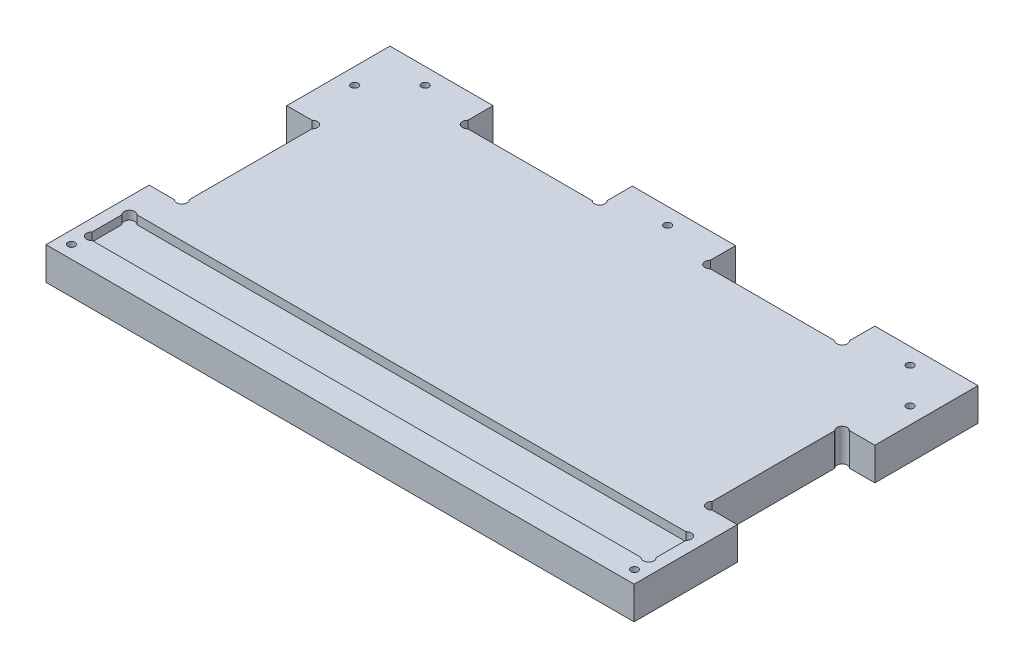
ISO-10303-21;
HEADER;
FILE_DESCRIPTION(('STEP AP214'),'2;1');
FILE_NAME('part.step','',(''),(''),'','','');
FILE_SCHEMA(('AUTOMOTIVE_DESIGN { 1 0 10303 214 1 1 1 1 }'));
ENDSEC;
DATA;
#1=APPLICATION_CONTEXT('core data for automotive mechanical design processes');
#2=APPLICATION_PROTOCOL_DEFINITION('international standard','automotive_design',2000,#1);
#3=PRODUCT_CONTEXT('',#1,'mechanical');
#4=PRODUCT('Part','Part','',(#3));
#5=PRODUCT_RELATED_PRODUCT_CATEGORY('part','',(#4));
#6=PRODUCT_DEFINITION_FORMATION('','',#4);
#7=PRODUCT_DEFINITION_CONTEXT('part definition',#1,'design');
#8=PRODUCT_DEFINITION('design','',#6,#7);
#9=PRODUCT_DEFINITION_SHAPE('','',#8);
#10=(LENGTH_UNIT() NAMED_UNIT(*) SI_UNIT(.MILLI.,.METRE.));
#11=(NAMED_UNIT(*) PLANE_ANGLE_UNIT() SI_UNIT($,.RADIAN.));
#12=(NAMED_UNIT(*) SI_UNIT($,.STERADIAN.) SOLID_ANGLE_UNIT());
#13=UNCERTAINTY_MEASURE_WITH_UNIT(LENGTH_MEASURE(1.E-05),#10,'distance_accuracy_value','');
#14=(GEOMETRIC_REPRESENTATION_CONTEXT(3) GLOBAL_UNCERTAINTY_ASSIGNED_CONTEXT((#13)) GLOBAL_UNIT_ASSIGNED_CONTEXT((#10,
#11,#12)) REPRESENTATION_CONTEXT('',''));
#15=CARTESIAN_POINT('',(0.,0.,0.));
#16=DIRECTION('',(0.,0.,1.));
#17=DIRECTION('',(1.,0.,0.));
#18=AXIS2_PLACEMENT_3D('',#15,#16,#17);
#19=CARTESIAN_POINT('',(332.9,-19.,-17.6));
#20=DIRECTION('',(0.,1.,0.));
#21=DIRECTION('',(0.,0.,1.));
#22=AXIS2_PLACEMENT_3D('',#19,#20,#21);
#23=CYLINDRICAL_SURFACE('',#22,3.09999999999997);
#24=CARTESIAN_POINT('',(332.9,-5.,-17.6));
#25=DIRECTION('',(0.,-1.,0.));
#26=DIRECTION('',(0.,0.,-1.));
#27=AXIS2_PLACEMENT_3D('',#24,#25,#26);
#28=CIRCLE('',#27,3.09999999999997);
#29=CARTESIAN_POINT('',(330.619649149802,-5.,-15.5));
#30=VERTEX_POINT('',#29);
#31=CARTESIAN_POINT('',(335.,-5.,-19.8803508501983));
#32=VERTEX_POINT('',#31);
#33=EDGE_CURVE('E47',#30,#32,#28,.F.);
#34=ORIENTED_EDGE('',*,*,#33,.F.);
#35=DIRECTION('',(0.,1.,0.));
#36=VECTOR('',#35,1.);
#37=CARTESIAN_POINT('',(330.619649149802,-19.,-15.5));
#38=LINE('',#37,#36);
#39=CARTESIAN_POINT('',(330.619649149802,0.,-15.5));
#40=VERTEX_POINT('',#39);
#41=EDGE_CURVE('E354',#30,#40,#38,.T.);
#42=ORIENTED_EDGE('',*,*,#41,.T.);
#43=CARTESIAN_POINT('',(332.9,0.,-17.6));
#44=DIRECTION('',(0.,1.,0.));
#45=DIRECTION('',(0.,0.,1.));
#46=AXIS2_PLACEMENT_3D('',#43,#44,#45);
#47=CIRCLE('',#46,3.09999999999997);
#48=CARTESIAN_POINT('',(335.,0.,-19.8803508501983));
#49=VERTEX_POINT('',#48);
#50=EDGE_CURVE('E331',#40,#49,#47,.T.);
#51=ORIENTED_EDGE('',*,*,#50,.T.);
#52=DIRECTION('',(0.,1.,0.));
#53=VECTOR('',#52,1.);
#54=CARTESIAN_POINT('',(335.,-19.,-19.8803508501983));
#55=LINE('',#54,#53);
#56=EDGE_CURVE('E274',#32,#49,#55,.T.);
#57=ORIENTED_EDGE('',*,*,#56,.F.);
#58=EDGE_LOOP('',(#34,#42,#51,#57));
#59=FACE_BOUND('',#58,.T.);
#60=ADVANCED_FACE('F32',(#59),#23,.F.);
#61=CARTESIAN_POINT('',(11.3803508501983,-19.,-15.5));
#62=DIRECTION('',(0.,0.,1.));
#63=DIRECTION('',(1.,0.,0.));
#64=AXIS2_PLACEMENT_3D('',#61,#62,#63);
#65=PLANE('',#64);
#66=DIRECTION('',(1.,0.,0.));
#67=VECTOR('',#66,1.);
#68=CARTESIAN_POINT('',(11.3803508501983,-5.,-15.5));
#69=LINE('',#68,#67);
#70=CARTESIAN_POINT('',(11.3803508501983,-5.,-15.5));
#71=VERTEX_POINT('',#70);
#72=EDGE_CURVE('E54',#71,#30,#69,.T.);
#73=ORIENTED_EDGE('',*,*,#72,.F.);
#74=DIRECTION('',(0.,1.,0.));
#75=VECTOR('',#74,1.);
#76=CARTESIAN_POINT('',(11.3803508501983,-19.,-15.5));
#77=LINE('',#76,#75);
#78=CARTESIAN_POINT('',(11.3803508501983,0.,-15.5));
#79=VERTEX_POINT('',#78);
#80=EDGE_CURVE('E357',#71,#79,#77,.T.);
#81=ORIENTED_EDGE('',*,*,#80,.T.);
#82=DIRECTION('',(1.,0.,0.));
#83=VECTOR('',#82,1.);
#84=CARTESIAN_POINT('',(11.3803508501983,0.,-15.5));
#85=LINE('',#84,#83);
#86=EDGE_CURVE('E351',#79,#40,#85,.T.);
#87=ORIENTED_EDGE('',*,*,#86,.T.);
#88=ORIENTED_EDGE('',*,*,#41,.F.);
#89=EDGE_LOOP('',(#73,#81,#87,#88));
#90=FACE_BOUND('',#89,.T.);
#91=ADVANCED_FACE('F711',(#90),#65,.F.);
#92=CARTESIAN_POINT('',(9.09999999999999,-19.,-17.6));
#93=DIRECTION('',(0.,1.,0.));
#94=DIRECTION('',(0.,0.,1.));
#95=AXIS2_PLACEMENT_3D('',#92,#93,#94);
#96=CYLINDRICAL_SURFACE('',#95,3.1);
#97=CARTESIAN_POINT('',(9.09999999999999,-5.,-17.6));
#98=DIRECTION('',(0.,-1.,0.));
#99=DIRECTION('',(0.,0.,-1.));
#100=AXIS2_PLACEMENT_3D('',#97,#98,#99);
#101=CIRCLE('',#100,3.1);
#102=CARTESIAN_POINT('',(7.,-5.,-19.8803508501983));
#103=VERTEX_POINT('',#102);
#104=EDGE_CURVE('E291',#103,#71,#101,.F.);
#105=ORIENTED_EDGE('',*,*,#104,.F.);
#106=DIRECTION('',(0.,1.,0.));
#107=VECTOR('',#106,1.);
#108=CARTESIAN_POINT('',(7.,-19.,-19.8803508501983));
#109=LINE('',#108,#107);
#110=CARTESIAN_POINT('',(7.,0.,-19.8803508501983));
#111=VERTEX_POINT('',#110);
#112=EDGE_CURVE('E359',#103,#111,#109,.T.);
#113=ORIENTED_EDGE('',*,*,#112,.T.);
#114=CARTESIAN_POINT('',(9.09999999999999,0.,-17.6));
#115=DIRECTION('',(0.,1.,0.));
#116=DIRECTION('',(0.,0.,1.));
#117=AXIS2_PLACEMENT_3D('',#114,#115,#116);
#118=CIRCLE('',#117,3.1);
#119=EDGE_CURVE('E348',#111,#79,#118,.T.);
#120=ORIENTED_EDGE('',*,*,#119,.T.);
#121=ORIENTED_EDGE('',*,*,#80,.F.);
#122=EDGE_LOOP('',(#105,#113,#120,#121));
#123=FACE_BOUND('',#122,.T.);
#124=ADVANCED_FACE('F716',(#123),#96,.F.);
#125=CARTESIAN_POINT('',(7.,-19.,-37.1196491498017));
#126=DIRECTION('',(-1.,0.,0.));
#127=DIRECTION('',(0.,0.,1.));
#128=AXIS2_PLACEMENT_3D('',#125,#126,#127);
#129=PLANE('',#128);
#130=DIRECTION('',(0.,0.,1.));
#131=VECTOR('',#130,1.);
#132=CARTESIAN_POINT('',(7.,-5.,-37.1196491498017));
#133=LINE('',#132,#131);
#134=CARTESIAN_POINT('',(7.,-5.,-37.1196491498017));
#135=VERTEX_POINT('',#134);
#136=EDGE_CURVE('E759',#135,#103,#133,.T.);
#137=ORIENTED_EDGE('',*,*,#136,.F.);
#138=DIRECTION('',(0.,1.,0.));
#139=VECTOR('',#138,1.);
#140=CARTESIAN_POINT('',(7.,-19.,-37.1196491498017));
#141=LINE('',#140,#139);
#142=CARTESIAN_POINT('',(7.,0.,-37.1196491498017));
#143=VERTEX_POINT('',#142);
#144=EDGE_CURVE('E361',#135,#143,#141,.T.);
#145=ORIENTED_EDGE('',*,*,#144,.T.);
#146=DIRECTION('',(0.,0.,1.));
#147=VECTOR('',#146,1.);
#148=CARTESIAN_POINT('',(7.,0.,-37.1196491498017));
#149=LINE('',#148,#147);
#150=EDGE_CURVE('E345',#143,#111,#149,.T.);
#151=ORIENTED_EDGE('',*,*,#150,.T.);
#152=ORIENTED_EDGE('',*,*,#112,.F.);
#153=EDGE_LOOP('',(#137,#145,#151,#152));
#154=FACE_BOUND('',#153,.T.);
#155=ADVANCED_FACE('F756',(#154),#129,.F.);
#156=CARTESIAN_POINT('',(9.09999999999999,-19.,-39.4));
#157=DIRECTION('',(0.,1.,0.));
#158=DIRECTION('',(0.,0.,1.));
#159=AXIS2_PLACEMENT_3D('',#156,#157,#158);
#160=CYLINDRICAL_SURFACE('',#159,3.1);
#161=CARTESIAN_POINT('',(9.09999999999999,-5.,-39.4));
#162=DIRECTION('',(0.,-1.,0.));
#163=DIRECTION('',(0.,0.,-1.));
#164=AXIS2_PLACEMENT_3D('',#161,#162,#163);
#165=CIRCLE('',#164,3.1);
#166=CARTESIAN_POINT('',(11.3803508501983,-5.,-41.5));
#167=VERTEX_POINT('',#166);
#168=EDGE_CURVE('E764',#167,#135,#165,.F.);
#169=ORIENTED_EDGE('',*,*,#168,.F.);
#170=DIRECTION('',(0.,1.,0.));
#171=VECTOR('',#170,1.);
#172=CARTESIAN_POINT('',(11.3803508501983,-19.,-41.5));
#173=LINE('',#172,#171);
#174=CARTESIAN_POINT('',(11.3803508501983,0.,-41.5));
#175=VERTEX_POINT('',#174);
#176=EDGE_CURVE('E363',#167,#175,#173,.T.);
#177=ORIENTED_EDGE('',*,*,#176,.T.);
#178=CARTESIAN_POINT('',(9.09999999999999,0.,-39.4));
#179=DIRECTION('',(0.,1.,0.));
#180=DIRECTION('',(0.,0.,1.));
#181=AXIS2_PLACEMENT_3D('',#178,#179,#180);
#182=CIRCLE('',#181,3.1);
#183=EDGE_CURVE('E342',#175,#143,#182,.T.);
#184=ORIENTED_EDGE('',*,*,#183,.T.);
#185=ORIENTED_EDGE('',*,*,#144,.F.);
#186=EDGE_LOOP('',(#169,#177,#184,#185));
#187=FACE_BOUND('',#186,.T.);
#188=ADVANCED_FACE('F762',(#187),#160,.F.);
#189=CARTESIAN_POINT('',(11.3803508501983,-19.,-41.5));
#190=DIRECTION('',(0.,0.,-1.));
#191=DIRECTION('',(-1.,0.,0.));
#192=AXIS2_PLACEMENT_3D('',#189,#190,#191);
#193=PLANE('',#192);
#194=DIRECTION('',(-1.,0.,0.));
#195=VECTOR('',#194,1.);
#196=CARTESIAN_POINT('',(11.3803508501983,-5.,-41.5));
#197=LINE('',#196,#195);
#198=CARTESIAN_POINT('',(330.619649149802,-5.,-41.5));
#199=VERTEX_POINT('',#198);
#200=EDGE_CURVE('E282',#199,#167,#197,.T.);
#201=ORIENTED_EDGE('',*,*,#200,.F.);
#202=DIRECTION('',(0.,1.,0.));
#203=VECTOR('',#202,1.);
#204=CARTESIAN_POINT('',(330.619649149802,-19.,-41.5));
#205=LINE('',#204,#203);
#206=CARTESIAN_POINT('',(330.619649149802,0.,-41.5));
#207=VERTEX_POINT('',#206);
#208=EDGE_CURVE('E273',#199,#207,#205,.T.);
#209=ORIENTED_EDGE('',*,*,#208,.T.);
#210=DIRECTION('',(-1.,0.,0.));
#211=VECTOR('',#210,1.);
#212=CARTESIAN_POINT('',(11.3803508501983,0.,-41.5));
#213=LINE('',#212,#211);
#214=EDGE_CURVE('E339',#207,#175,#213,.T.);
#215=ORIENTED_EDGE('',*,*,#214,.T.);
#216=ORIENTED_EDGE('',*,*,#176,.F.);
#217=EDGE_LOOP('',(#201,#209,#215,#216));
#218=FACE_BOUND('',#217,.T.);
#219=ADVANCED_FACE('F766',(#218),#193,.F.);
#220=CARTESIAN_POINT('',(332.9,-19.,-39.4));
#221=DIRECTION('',(0.,1.,0.));
#222=DIRECTION('',(0.,0.,1.));
#223=AXIS2_PLACEMENT_3D('',#220,#221,#222);
#224=CYLINDRICAL_SURFACE('',#223,3.1);
#225=CARTESIAN_POINT('',(332.9,-5.,-39.4));
#226=DIRECTION('',(0.,-1.,0.));
#227=DIRECTION('',(0.,0.,-1.));
#228=AXIS2_PLACEMENT_3D('',#225,#226,#227);
#229=CIRCLE('',#228,3.1);
#230=CARTESIAN_POINT('',(335.,-5.,-37.1196491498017));
#231=VERTEX_POINT('',#230);
#232=EDGE_CURVE('E278',#231,#199,#229,.F.);
#233=ORIENTED_EDGE('',*,*,#232,.F.);
#234=DIRECTION('',(0.,1.,0.));
#235=VECTOR('',#234,1.);
#236=CARTESIAN_POINT('',(335.,-19.,-37.1196491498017));
#237=LINE('',#236,#235);
#238=CARTESIAN_POINT('',(335.,0.,-37.1196491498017));
#239=VERTEX_POINT('',#238);
#240=EDGE_CURVE('E265',#231,#239,#237,.T.);
#241=ORIENTED_EDGE('',*,*,#240,.T.);
#242=CARTESIAN_POINT('',(332.9,0.,-39.4));
#243=DIRECTION('',(0.,1.,0.));
#244=DIRECTION('',(0.,0.,1.));
#245=AXIS2_PLACEMENT_3D('',#242,#243,#244);
#246=CIRCLE('',#245,3.1);
#247=EDGE_CURVE('E337',#239,#207,#246,.T.);
#248=ORIENTED_EDGE('',*,*,#247,.T.);
#249=ORIENTED_EDGE('',*,*,#208,.F.);
#250=EDGE_LOOP('',(#233,#241,#248,#249));
#251=FACE_BOUND('',#250,.T.);
#252=ADVANCED_FACE('F279',(#251),#224,.F.);
#253=CARTESIAN_POINT('',(335.,-19.,-37.1196491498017));
#254=DIRECTION('',(1.,0.,0.));
#255=DIRECTION('',(0.,0.,-1.));
#256=AXIS2_PLACEMENT_3D('',#253,#254,#255);
#257=PLANE('',#256);
#258=DIRECTION('',(0.,0.,-1.));
#259=VECTOR('',#258,1.);
#260=CARTESIAN_POINT('',(335.,-5.,-37.1196491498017));
#261=LINE('',#260,#259);
#262=EDGE_CURVE('E11',#32,#231,#261,.T.);
#263=ORIENTED_EDGE('',*,*,#262,.F.);
#264=ORIENTED_EDGE('',*,*,#56,.T.);
#265=DIRECTION('',(0.,0.,-1.));
#266=VECTOR('',#265,1.);
#267=CARTESIAN_POINT('',(335.,0.,-37.1196491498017));
#268=LINE('',#267,#266);
#269=EDGE_CURVE('E269',#49,#239,#268,.T.);
#270=ORIENTED_EDGE('',*,*,#269,.T.);
#271=ORIENTED_EDGE('',*,*,#240,.F.);
#272=EDGE_LOOP('',(#263,#264,#270,#271));
#273=FACE_BOUND('',#272,.T.);
#274=ADVANCED_FACE('F267',(#273),#257,.F.);
#275=CARTESIAN_POINT('',(0.,-19.,0.));
#276=DIRECTION('',(-1.,0.,0.));
#277=DIRECTION('',(0.,0.,1.));
#278=AXIS2_PLACEMENT_3D('',#275,#276,#277);
#279=PLANE('',#278);
#280=DIRECTION('',(0.,0.,1.));
#281=VECTOR('',#280,1.);
#282=CARTESIAN_POINT('',(0.,0.,0.));
#283=LINE('',#282,#281);
#284=CARTESIAN_POINT('',(0.,0.,-60.));
#285=VERTEX_POINT('',#284);
#286=CARTESIAN_POINT('',(0.,0.,0.));
#287=VERTEX_POINT('',#286);
#288=EDGE_CURVE('E356',#285,#287,#283,.T.);
#289=ORIENTED_EDGE('',*,*,#288,.F.);
#290=DIRECTION('',(0.,1.,0.));
#291=VECTOR('',#290,1.);
#292=CARTESIAN_POINT('',(0.,-19.,-60.));
#293=LINE('',#292,#291);
#294=CARTESIAN_POINT('',(0.,-19.,-60.));
#295=VERTEX_POINT('',#294);
#296=EDGE_CURVE('E40',#295,#285,#293,.T.);
#297=ORIENTED_EDGE('',*,*,#296,.F.);
#298=DIRECTION('',(0.,0.,1.));
#299=VECTOR('',#298,1.);
#300=CARTESIAN_POINT('',(0.,-19.,0.));
#301=LINE('',#300,#299);
#302=CARTESIAN_POINT('',(0.,-19.,0.));
#303=VERTEX_POINT('',#302);
#304=EDGE_CURVE('E367',#295,#303,#301,.T.);
#305=ORIENTED_EDGE('',*,*,#304,.T.);
#306=DIRECTION('',(0.,1.,0.));
#307=VECTOR('',#306,1.);
#308=CARTESIAN_POINT('',(0.,-19.,0.));
#309=LINE('',#308,#307);
#310=EDGE_CURVE('E452',#303,#287,#309,.T.);
#311=ORIENTED_EDGE('',*,*,#310,.T.);
#312=EDGE_LOOP('',(#289,#297,#305,#311));
#313=FACE_BOUND('',#312,.T.);
#314=ADVANCED_FACE('F34',(#313),#279,.T.);
#315=CARTESIAN_POINT('',(14.6881003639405,-19.,-60.));
#316=DIRECTION('',(0.,0.,-1.));
#317=DIRECTION('',(-1.,0.,0.));
#318=AXIS2_PLACEMENT_3D('',#315,#316,#317);
#319=PLANE('',#318);
#320=DIRECTION('',(-1.,0.,0.));
#321=VECTOR('',#320,1.);
#322=CARTESIAN_POINT('',(14.6881003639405,0.,-60.));
#323=LINE('',#322,#321);
#324=CARTESIAN_POINT('',(14.6881003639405,0.,-60.));
#325=VERTEX_POINT('',#324);
#326=EDGE_CURVE('E371',#325,#285,#323,.T.);
#327=ORIENTED_EDGE('',*,*,#326,.F.);
#328=DIRECTION('',(0.,1.,0.));
#329=VECTOR('',#328,1.);
#330=CARTESIAN_POINT('',(14.6881003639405,-19.,-60.));
#331=LINE('',#330,#329);
#332=CARTESIAN_POINT('',(14.6881003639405,-19.,-60.));
#333=VERTEX_POINT('',#332);
#334=EDGE_CURVE('E536',#333,#325,#331,.T.);
#335=ORIENTED_EDGE('',*,*,#334,.F.);
#336=DIRECTION('',(-1.,0.,0.));
#337=VECTOR('',#336,1.);
#338=CARTESIAN_POINT('',(14.6881003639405,-19.,-60.));
#339=LINE('',#338,#337);
#340=EDGE_CURVE('E449',#333,#295,#339,.T.);
#341=ORIENTED_EDGE('',*,*,#340,.T.);
#342=ORIENTED_EDGE('',*,*,#296,.T.);
#343=EDGE_LOOP('',(#327,#335,#341,#342));
#344=FACE_BOUND('',#343,.T.);
#345=ADVANCED_FACE('F600',(#344),#319,.T.);
#346=CARTESIAN_POINT('',(16.9,-19.,-62.1));
#347=DIRECTION('',(0.,1.,0.));
#348=DIRECTION('',(0.,0.,1.));
#349=AXIS2_PLACEMENT_3D('',#346,#347,#348);
#350=CYLINDRICAL_SURFACE('',#349,3.05000000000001);
#351=CARTESIAN_POINT('',(16.9,0.,-62.1));
#352=DIRECTION('',(0.,-1.,0.));
#353=DIRECTION('',(0.,0.,1.));
#354=AXIS2_PLACEMENT_3D('',#351,#352,#353);
#355=CIRCLE('',#354,3.05000000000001);
#356=CARTESIAN_POINT('',(19.,0.,-64.3118996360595));
#357=VERTEX_POINT('',#356);
#358=EDGE_CURVE('E530',#357,#325,#355,.T.);
#359=ORIENTED_EDGE('',*,*,#358,.F.);
#360=DIRECTION('',(0.,1.,0.));
#361=VECTOR('',#360,1.);
#362=CARTESIAN_POINT('',(19.,-19.,-64.3118996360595));
#363=LINE('',#362,#361);
#364=CARTESIAN_POINT('',(19.,-19.,-64.3118996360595));
#365=VERTEX_POINT('',#364);
#366=EDGE_CURVE('E538',#365,#357,#363,.T.);
#367=ORIENTED_EDGE('',*,*,#366,.F.);
#368=CARTESIAN_POINT('',(16.9,-19.,-62.1));
#369=DIRECTION('',(0.,-1.,0.));
#370=DIRECTION('',(0.,0.,1.));
#371=AXIS2_PLACEMENT_3D('',#368,#369,#370);
#372=CIRCLE('',#371,3.05000000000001);
#373=EDGE_CURVE('E446',#365,#333,#372,.T.);
#374=ORIENTED_EDGE('',*,*,#373,.T.);
#375=ORIENTED_EDGE('',*,*,#334,.T.);
#376=EDGE_LOOP('',(#359,#367,#374,#375));
#377=FACE_BOUND('',#376,.T.);
#378=ADVANCED_FACE('F701',(#377),#350,.F.);
#379=CARTESIAN_POINT('',(19.,-19.,-135.688100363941));
#380=DIRECTION('',(-1.,0.,0.));
#381=DIRECTION('',(0.,0.,1.));
#382=AXIS2_PLACEMENT_3D('',#379,#380,#381);
#383=PLANE('',#382);
#384=DIRECTION('',(0.,0.,1.));
#385=VECTOR('',#384,1.);
#386=CARTESIAN_POINT('',(19.,0.,-135.688100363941));
#387=LINE('',#386,#385);
#388=CARTESIAN_POINT('',(19.,0.,-135.688100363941));
#389=VERTEX_POINT('',#388);
#390=EDGE_CURVE('E527',#389,#357,#387,.T.);
#391=ORIENTED_EDGE('',*,*,#390,.F.);
#392=DIRECTION('',(0.,1.,0.));
#393=VECTOR('',#392,1.);
#394=CARTESIAN_POINT('',(19.,-19.,-135.688100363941));
#395=LINE('',#394,#393);
#396=CARTESIAN_POINT('',(19.,-19.,-135.688100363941));
#397=VERTEX_POINT('',#396);
#398=EDGE_CURVE('E540',#397,#389,#395,.T.);
#399=ORIENTED_EDGE('',*,*,#398,.F.);
#400=DIRECTION('',(0.,0.,1.));
#401=VECTOR('',#400,1.);
#402=CARTESIAN_POINT('',(19.,-19.,-135.688100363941));
#403=LINE('',#402,#401);
#404=EDGE_CURVE('E443',#397,#365,#403,.T.);
#405=ORIENTED_EDGE('',*,*,#404,.T.);
#406=ORIENTED_EDGE('',*,*,#366,.T.);
#407=EDGE_LOOP('',(#391,#399,#405,#406));
#408=FACE_BOUND('',#407,.T.);
#409=ADVANCED_FACE('F699',(#408),#383,.T.);
#410=CARTESIAN_POINT('',(16.9,-19.,-137.9));
#411=DIRECTION('',(0.,1.,0.));
#412=DIRECTION('',(0.,0.,1.));
#413=AXIS2_PLACEMENT_3D('',#410,#411,#412);
#414=CYLINDRICAL_SURFACE('',#413,3.05);
#415=CARTESIAN_POINT('',(16.9,0.,-137.9));
#416=DIRECTION('',(0.,-1.,0.));
#417=DIRECTION('',(0.,0.,1.));
#418=AXIS2_PLACEMENT_3D('',#415,#416,#417);
#419=CIRCLE('',#418,3.05);
#420=CARTESIAN_POINT('',(14.6881003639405,0.,-140.));
#421=VERTEX_POINT('',#420);
#422=EDGE_CURVE('E524',#421,#389,#419,.T.);
#423=ORIENTED_EDGE('',*,*,#422,.F.);
#424=DIRECTION('',(0.,1.,0.));
#425=VECTOR('',#424,1.);
#426=CARTESIAN_POINT('',(14.6881003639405,-19.,-140.));
#427=LINE('',#426,#425);
#428=CARTESIAN_POINT('',(14.6881003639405,-19.,-140.));
#429=VERTEX_POINT('',#428);
#430=EDGE_CURVE('E542',#429,#421,#427,.T.);
#431=ORIENTED_EDGE('',*,*,#430,.F.);
#432=CARTESIAN_POINT('',(16.9,-19.,-137.9));
#433=DIRECTION('',(0.,-1.,0.));
#434=DIRECTION('',(0.,0.,1.));
#435=AXIS2_PLACEMENT_3D('',#432,#433,#434);
#436=CIRCLE('',#435,3.05);
#437=EDGE_CURVE('E440',#429,#397,#436,.T.);
#438=ORIENTED_EDGE('',*,*,#437,.T.);
#439=ORIENTED_EDGE('',*,*,#398,.T.);
#440=EDGE_LOOP('',(#423,#431,#438,#439));
#441=FACE_BOUND('',#440,.T.);
#442=ADVANCED_FACE('F695',(#441),#414,.F.);
#443=CARTESIAN_POINT('',(0.,-19.,-140.));
#444=DIRECTION('',(0.,0.,1.));
#445=DIRECTION('',(1.,0.,0.));
#446=AXIS2_PLACEMENT_3D('',#443,#444,#445);
#447=PLANE('',#446);
#448=DIRECTION('',(1.,0.,0.));
#449=VECTOR('',#448,1.);
#450=CARTESIAN_POINT('',(0.,0.,-140.));
#451=LINE('',#450,#449);
#452=CARTESIAN_POINT('',(0.,0.,-140.));
#453=VERTEX_POINT('',#452);
#454=EDGE_CURVE('E521',#453,#421,#451,.T.);
#455=ORIENTED_EDGE('',*,*,#454,.F.);
#456=DIRECTION('',(0.,1.,0.));
#457=VECTOR('',#456,1.);
#458=CARTESIAN_POINT('',(0.,-19.,-140.));
#459=LINE('',#458,#457);
#460=CARTESIAN_POINT('',(0.,-19.,-140.));
#461=VERTEX_POINT('',#460);
#462=EDGE_CURVE('E544',#461,#453,#459,.T.);
#463=ORIENTED_EDGE('',*,*,#462,.F.);
#464=DIRECTION('',(1.,0.,0.));
#465=VECTOR('',#464,1.);
#466=CARTESIAN_POINT('',(0.,-19.,-140.));
#467=LINE('',#466,#465);
#468=EDGE_CURVE('E437',#461,#429,#467,.T.);
#469=ORIENTED_EDGE('',*,*,#468,.T.);
#470=ORIENTED_EDGE('',*,*,#430,.T.);
#471=EDGE_LOOP('',(#455,#463,#469,#470));
#472=FACE_BOUND('',#471,.T.);
#473=ADVANCED_FACE('F691',(#472),#447,.T.);
#474=CARTESIAN_POINT('',(0.,-19.,-140.));
#475=DIRECTION('',(-1.,0.,0.));
#476=DIRECTION('',(0.,0.,1.));
#477=AXIS2_PLACEMENT_3D('',#474,#475,#476);
#478=PLANE('',#477);
#479=DIRECTION('',(0.,0.,1.));
#480=VECTOR('',#479,1.);
#481=CARTESIAN_POINT('',(0.,0.,-140.));
#482=LINE('',#481,#480);
#483=CARTESIAN_POINT('',(0.,0.,-200.));
#484=VERTEX_POINT('',#483);
#485=EDGE_CURVE('E518',#484,#453,#482,.T.);
#486=ORIENTED_EDGE('',*,*,#485,.F.);
#487=DIRECTION('',(0.,1.,0.));
#488=VECTOR('',#487,1.);
#489=CARTESIAN_POINT('',(0.,-19.,-200.));
#490=LINE('',#489,#488);
#491=CARTESIAN_POINT('',(0.,-19.,-200.));
#492=VERTEX_POINT('',#491);
#493=EDGE_CURVE('E546',#492,#484,#490,.T.);
#494=ORIENTED_EDGE('',*,*,#493,.F.);
#495=DIRECTION('',(0.,0.,1.));
#496=VECTOR('',#495,1.);
#497=CARTESIAN_POINT('',(0.,-19.,-140.));
#498=LINE('',#497,#496);
#499=EDGE_CURVE('E434',#492,#461,#498,.T.);
#500=ORIENTED_EDGE('',*,*,#499,.T.);
#501=ORIENTED_EDGE('',*,*,#462,.T.);
#502=EDGE_LOOP('',(#486,#494,#500,#501));
#503=FACE_BOUND('',#502,.T.);
#504=ADVANCED_FACE('F687',(#503),#478,.T.);
#505=CARTESIAN_POINT('',(0.,-19.,-200.));
#506=DIRECTION('',(0.,0.,-1.));
#507=DIRECTION('',(-1.,0.,0.));
#508=AXIS2_PLACEMENT_3D('',#505,#506,#507);
#509=PLANE('',#508);
#510=DIRECTION('',(-1.,0.,0.));
#511=VECTOR('',#510,1.);
#512=CARTESIAN_POINT('',(0.,0.,-200.));
#513=LINE('',#512,#511);
#514=CARTESIAN_POINT('',(59.9999999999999,0.,-200.));
#515=VERTEX_POINT('',#514);
#516=EDGE_CURVE('E515',#515,#484,#513,.T.);
#517=ORIENTED_EDGE('',*,*,#516,.F.);
#518=DIRECTION('',(0.,1.,0.));
#519=VECTOR('',#518,1.);
#520=CARTESIAN_POINT('',(59.9999999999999,-19.,-200.));
#521=LINE('',#520,#519);
#522=CARTESIAN_POINT('',(59.9999999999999,-19.,-200.));
#523=VERTEX_POINT('',#522);
#524=EDGE_CURVE('E548',#523,#515,#521,.T.);
#525=ORIENTED_EDGE('',*,*,#524,.F.);
#526=DIRECTION('',(-1.,0.,0.));
#527=VECTOR('',#526,1.);
#528=CARTESIAN_POINT('',(0.,-19.,-200.));
#529=LINE('',#528,#527);
#530=EDGE_CURVE('E431',#523,#492,#529,.T.);
#531=ORIENTED_EDGE('',*,*,#530,.T.);
#532=ORIENTED_EDGE('',*,*,#493,.T.);
#533=EDGE_LOOP('',(#517,#525,#531,#532));
#534=FACE_BOUND('',#533,.T.);
#535=ADVANCED_FACE('F683',(#534),#509,.T.);
#536=CARTESIAN_POINT('',(59.9999999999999,-19.,-200.));
#537=DIRECTION('',(1.,0.,0.));
#538=DIRECTION('',(0.,0.,-1.));
#539=AXIS2_PLACEMENT_3D('',#536,#537,#538);
#540=PLANE('',#539);
#541=DIRECTION('',(0.,0.,-1.));
#542=VECTOR('',#541,1.);
#543=CARTESIAN_POINT('',(59.9999999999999,0.,-200.));
#544=LINE('',#543,#542);
#545=CARTESIAN_POINT('',(60.,0.,-185.311899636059));
#546=VERTEX_POINT('',#545);
#547=EDGE_CURVE('E512',#546,#515,#544,.T.);
#548=ORIENTED_EDGE('',*,*,#547,.F.);
#549=DIRECTION('',(0.,1.,0.));
#550=VECTOR('',#549,1.);
#551=CARTESIAN_POINT('',(60.,-19.,-185.311899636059));
#552=LINE('',#551,#550);
#553=CARTESIAN_POINT('',(60.,-19.,-185.311899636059));
#554=VERTEX_POINT('',#553);
#555=EDGE_CURVE('E550',#554,#546,#552,.T.);
#556=ORIENTED_EDGE('',*,*,#555,.F.);
#557=DIRECTION('',(0.,0.,-1.));
#558=VECTOR('',#557,1.);
#559=CARTESIAN_POINT('',(59.9999999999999,-19.,-200.));
#560=LINE('',#559,#558);
#561=EDGE_CURVE('E428',#554,#523,#560,.T.);
#562=ORIENTED_EDGE('',*,*,#561,.T.);
#563=ORIENTED_EDGE('',*,*,#524,.T.);
#564=EDGE_LOOP('',(#548,#556,#562,#563));
#565=FACE_BOUND('',#564,.T.);
#566=ADVANCED_FACE('F679',(#565),#540,.T.);
#567=CARTESIAN_POINT('',(62.1,-19.,-183.1));
#568=DIRECTION('',(0.,1.,0.));
#569=DIRECTION('',(0.,0.,1.));
#570=AXIS2_PLACEMENT_3D('',#567,#568,#569);
#571=CYLINDRICAL_SURFACE('',#570,3.04999999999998);
#572=CARTESIAN_POINT('',(62.1,0.,-183.1));
#573=DIRECTION('',(0.,-1.,0.));
#574=DIRECTION('',(0.,0.,1.));
#575=AXIS2_PLACEMENT_3D('',#572,#573,#574);
#576=CIRCLE('',#575,3.04999999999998);
#577=CARTESIAN_POINT('',(64.3118996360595,0.,-181.));
#578=VERTEX_POINT('',#577);
#579=EDGE_CURVE('E509',#578,#546,#576,.T.);
#580=ORIENTED_EDGE('',*,*,#579,.F.);
#581=DIRECTION('',(0.,1.,0.));
#582=VECTOR('',#581,1.);
#583=CARTESIAN_POINT('',(64.3118996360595,-19.,-181.));
#584=LINE('',#583,#582);
#585=CARTESIAN_POINT('',(64.3118996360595,-19.,-181.));
#586=VERTEX_POINT('',#585);
#587=EDGE_CURVE('E552',#586,#578,#584,.T.);
#588=ORIENTED_EDGE('',*,*,#587,.F.);
#589=CARTESIAN_POINT('',(62.1,-19.,-183.1));
#590=DIRECTION('',(0.,-1.,0.));
#591=DIRECTION('',(0.,0.,1.));
#592=AXIS2_PLACEMENT_3D('',#589,#590,#591);
#593=CIRCLE('',#592,3.04999999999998);
#594=EDGE_CURVE('E425',#586,#554,#593,.T.);
#595=ORIENTED_EDGE('',*,*,#594,.T.);
#596=ORIENTED_EDGE('',*,*,#555,.T.);
#597=EDGE_LOOP('',(#580,#588,#595,#596));
#598=FACE_BOUND('',#597,.T.);
#599=ADVANCED_FACE('F675',(#598),#571,.F.);
#600=CARTESIAN_POINT('',(64.3118996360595,-19.,-181.));
#601=DIRECTION('',(0.,0.,-1.));
#602=DIRECTION('',(-1.,0.,0.));
#603=AXIS2_PLACEMENT_3D('',#600,#601,#602);
#604=PLANE('',#603);
#605=DIRECTION('',(-1.,0.,0.));
#606=VECTOR('',#605,1.);
#607=CARTESIAN_POINT('',(64.3118996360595,0.,-181.));
#608=LINE('',#607,#606);
#609=CARTESIAN_POINT('',(136.688100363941,0.,-181.));
#610=VERTEX_POINT('',#609);
#611=EDGE_CURVE('E506',#610,#578,#608,.T.);
#612=ORIENTED_EDGE('',*,*,#611,.F.);
#613=DIRECTION('',(0.,1.,0.));
#614=VECTOR('',#613,1.);
#615=CARTESIAN_POINT('',(136.688100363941,-19.,-181.));
#616=LINE('',#615,#614);
#617=CARTESIAN_POINT('',(136.688100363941,-19.,-181.));
#618=VERTEX_POINT('',#617);
#619=EDGE_CURVE('E554',#618,#610,#616,.T.);
#620=ORIENTED_EDGE('',*,*,#619,.F.);
#621=DIRECTION('',(-1.,0.,0.));
#622=VECTOR('',#621,1.);
#623=CARTESIAN_POINT('',(64.3118996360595,-19.,-181.));
#624=LINE('',#623,#622);
#625=EDGE_CURVE('E422',#618,#586,#624,.T.);
#626=ORIENTED_EDGE('',*,*,#625,.T.);
#627=ORIENTED_EDGE('',*,*,#587,.T.);
#628=EDGE_LOOP('',(#612,#620,#626,#627));
#629=FACE_BOUND('',#628,.T.);
#630=ADVANCED_FACE('F671',(#629),#604,.T.);
#631=CARTESIAN_POINT('',(138.9,-19.,-183.1));
#632=DIRECTION('',(0.,1.,0.));
#633=DIRECTION('',(0.,0.,1.));
#634=AXIS2_PLACEMENT_3D('',#631,#632,#633);
#635=CYLINDRICAL_SURFACE('',#634,3.05);
#636=CARTESIAN_POINT('',(138.9,0.,-183.1));
#637=DIRECTION('',(0.,-1.,0.));
#638=DIRECTION('',(0.,0.,1.));
#639=AXIS2_PLACEMENT_3D('',#636,#637,#638);
#640=CIRCLE('',#639,3.05);
#641=CARTESIAN_POINT('',(141.,0.,-185.311899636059));
#642=VERTEX_POINT('',#641);
#643=EDGE_CURVE('E503',#642,#610,#640,.T.);
#644=ORIENTED_EDGE('',*,*,#643,.F.);
#645=DIRECTION('',(0.,1.,0.));
#646=VECTOR('',#645,1.);
#647=CARTESIAN_POINT('',(141.,-19.,-185.311899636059));
#648=LINE('',#647,#646);
#649=CARTESIAN_POINT('',(141.,-19.,-185.311899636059));
#650=VERTEX_POINT('',#649);
#651=EDGE_CURVE('E556',#650,#642,#648,.T.);
#652=ORIENTED_EDGE('',*,*,#651,.F.);
#653=CARTESIAN_POINT('',(138.9,-19.,-183.1));
#654=DIRECTION('',(0.,-1.,0.));
#655=DIRECTION('',(0.,0.,1.));
#656=AXIS2_PLACEMENT_3D('',#653,#654,#655);
#657=CIRCLE('',#656,3.05);
#658=EDGE_CURVE('E419',#650,#618,#657,.T.);
#659=ORIENTED_EDGE('',*,*,#658,.T.);
#660=ORIENTED_EDGE('',*,*,#619,.T.);
#661=EDGE_LOOP('',(#644,#652,#659,#660));
#662=FACE_BOUND('',#661,.T.);
#663=ADVANCED_FACE('F667',(#662),#635,.F.);
#664=CARTESIAN_POINT('',(141.,-19.,-185.311899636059));
#665=DIRECTION('',(-1.,0.,0.));
#666=DIRECTION('',(0.,0.,1.));
#667=AXIS2_PLACEMENT_3D('',#664,#665,#666);
#668=PLANE('',#667);
#669=DIRECTION('',(0.,0.,1.));
#670=VECTOR('',#669,1.);
#671=CARTESIAN_POINT('',(141.,0.,-185.311899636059));
#672=LINE('',#671,#670);
#673=CARTESIAN_POINT('',(141.,0.,-200.));
#674=VERTEX_POINT('',#673);
#675=EDGE_CURVE('E500',#674,#642,#672,.T.);
#676=ORIENTED_EDGE('',*,*,#675,.F.);
#677=DIRECTION('',(0.,1.,0.));
#678=VECTOR('',#677,1.);
#679=CARTESIAN_POINT('',(141.,-19.,-200.));
#680=LINE('',#679,#678);
#681=CARTESIAN_POINT('',(141.,-19.,-200.));
#682=VERTEX_POINT('',#681);
#683=EDGE_CURVE('E558',#682,#674,#680,.T.);
#684=ORIENTED_EDGE('',*,*,#683,.F.);
#685=DIRECTION('',(0.,0.,1.));
#686=VECTOR('',#685,1.);
#687=CARTESIAN_POINT('',(141.,-19.,-185.311899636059));
#688=LINE('',#687,#686);
#689=EDGE_CURVE('E416',#682,#650,#688,.T.);
#690=ORIENTED_EDGE('',*,*,#689,.T.);
#691=ORIENTED_EDGE('',*,*,#651,.T.);
#692=EDGE_LOOP('',(#676,#684,#690,#691));
#693=FACE_BOUND('',#692,.T.);
#694=ADVANCED_FACE('F663',(#693),#668,.T.);
#695=CARTESIAN_POINT('',(141.,-19.,-200.));
#696=DIRECTION('',(0.,0.,-1.));
#697=DIRECTION('',(-1.,0.,0.));
#698=AXIS2_PLACEMENT_3D('',#695,#696,#697);
#699=PLANE('',#698);
#700=DIRECTION('',(-1.,0.,0.));
#701=VECTOR('',#700,1.);
#702=CARTESIAN_POINT('',(141.,0.,-200.));
#703=LINE('',#702,#701);
#704=CARTESIAN_POINT('',(201.,0.,-200.));
#705=VERTEX_POINT('',#704);
#706=EDGE_CURVE('E497',#705,#674,#703,.T.);
#707=ORIENTED_EDGE('',*,*,#706,.F.);
#708=DIRECTION('',(0.,1.,0.));
#709=VECTOR('',#708,1.);
#710=CARTESIAN_POINT('',(201.,-19.,-200.));
#711=LINE('',#710,#709);
#712=CARTESIAN_POINT('',(201.,-19.,-200.));
#713=VERTEX_POINT('',#712);
#714=EDGE_CURVE('E560',#713,#705,#711,.T.);
#715=ORIENTED_EDGE('',*,*,#714,.F.);
#716=DIRECTION('',(-1.,0.,0.));
#717=VECTOR('',#716,1.);
#718=CARTESIAN_POINT('',(141.,-19.,-200.));
#719=LINE('',#718,#717);
#720=EDGE_CURVE('E413',#713,#682,#719,.T.);
#721=ORIENTED_EDGE('',*,*,#720,.T.);
#722=ORIENTED_EDGE('',*,*,#683,.T.);
#723=EDGE_LOOP('',(#707,#715,#721,#722));
#724=FACE_BOUND('',#723,.T.);
#725=ADVANCED_FACE('F659',(#724),#699,.T.);
#726=CARTESIAN_POINT('',(201.,-19.,-185.311899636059));
#727=DIRECTION('',(1.,0.,0.));
#728=DIRECTION('',(0.,0.,-1.));
#729=AXIS2_PLACEMENT_3D('',#726,#727,#728);
#730=PLANE('',#729);
#731=DIRECTION('',(0.,0.,-1.));
#732=VECTOR('',#731,1.);
#733=CARTESIAN_POINT('',(201.,0.,-185.311899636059));
#734=LINE('',#733,#732);
#735=CARTESIAN_POINT('',(201.,0.,-185.311899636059));
#736=VERTEX_POINT('',#735);
#737=EDGE_CURVE('E494',#736,#705,#734,.T.);
#738=ORIENTED_EDGE('',*,*,#737,.F.);
#739=DIRECTION('',(0.,1.,0.));
#740=VECTOR('',#739,1.);
#741=CARTESIAN_POINT('',(201.,-19.,-185.311899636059));
#742=LINE('',#741,#740);
#743=CARTESIAN_POINT('',(201.,-19.,-185.311899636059));
#744=VERTEX_POINT('',#743);
#745=EDGE_CURVE('E562',#744,#736,#742,.T.);
#746=ORIENTED_EDGE('',*,*,#745,.F.);
#747=DIRECTION('',(0.,0.,-1.));
#748=VECTOR('',#747,1.);
#749=CARTESIAN_POINT('',(201.,-19.,-185.311899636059));
#750=LINE('',#749,#748);
#751=EDGE_CURVE('E410',#744,#713,#750,.T.);
#752=ORIENTED_EDGE('',*,*,#751,.T.);
#753=ORIENTED_EDGE('',*,*,#714,.T.);
#754=EDGE_LOOP('',(#738,#746,#752,#753));
#755=FACE_BOUND('',#754,.T.);
#756=ADVANCED_FACE('F655',(#755),#730,.T.);
#757=CARTESIAN_POINT('',(203.1,-19.,-183.1));
#758=DIRECTION('',(0.,1.,0.));
#759=DIRECTION('',(0.,0.,1.));
#760=AXIS2_PLACEMENT_3D('',#757,#758,#759);
#761=CYLINDRICAL_SURFACE('',#760,3.05);
#762=CARTESIAN_POINT('',(203.1,0.,-183.1));
#763=DIRECTION('',(0.,-1.,0.));
#764=DIRECTION('',(0.,0.,-1.));
#765=AXIS2_PLACEMENT_3D('',#762,#763,#764);
#766=CIRCLE('',#765,3.05);
#767=CARTESIAN_POINT('',(205.31189963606,0.,-181.));
#768=VERTEX_POINT('',#767);
#769=EDGE_CURVE('E491',#768,#736,#766,.T.);
#770=ORIENTED_EDGE('',*,*,#769,.F.);
#771=DIRECTION('',(0.,1.,0.));
#772=VECTOR('',#771,1.);
#773=CARTESIAN_POINT('',(205.31189963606,-19.,-181.));
#774=LINE('',#773,#772);
#775=CARTESIAN_POINT('',(205.31189963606,-19.,-181.));
#776=VERTEX_POINT('',#775);
#777=EDGE_CURVE('E564',#776,#768,#774,.T.);
#778=ORIENTED_EDGE('',*,*,#777,.F.);
#779=CARTESIAN_POINT('',(203.1,-19.,-183.1));
#780=DIRECTION('',(0.,-1.,0.));
#781=DIRECTION('',(0.,0.,-1.));
#782=AXIS2_PLACEMENT_3D('',#779,#780,#781);
#783=CIRCLE('',#782,3.05);
#784=EDGE_CURVE('E407',#776,#744,#783,.T.);
#785=ORIENTED_EDGE('',*,*,#784,.T.);
#786=ORIENTED_EDGE('',*,*,#745,.T.);
#787=EDGE_LOOP('',(#770,#778,#785,#786));
#788=FACE_BOUND('',#787,.T.);
#789=ADVANCED_FACE('F651',(#788),#761,.F.);
#790=CARTESIAN_POINT('',(277.688100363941,-19.,-181.));
#791=DIRECTION('',(0.,0.,-1.));
#792=DIRECTION('',(-1.,0.,0.));
#793=AXIS2_PLACEMENT_3D('',#790,#791,#792);
#794=PLANE('',#793);
#795=DIRECTION('',(-1.,0.,0.));
#796=VECTOR('',#795,1.);
#797=CARTESIAN_POINT('',(277.688100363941,0.,-181.));
#798=LINE('',#797,#796);
#799=CARTESIAN_POINT('',(277.688100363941,0.,-181.));
#800=VERTEX_POINT('',#799);
#801=EDGE_CURVE('E488',#800,#768,#798,.T.);
#802=ORIENTED_EDGE('',*,*,#801,.F.);
#803=DIRECTION('',(0.,1.,0.));
#804=VECTOR('',#803,1.);
#805=CARTESIAN_POINT('',(277.688100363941,-19.,-181.));
#806=LINE('',#805,#804);
#807=CARTESIAN_POINT('',(277.688100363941,-19.,-181.));
#808=VERTEX_POINT('',#807);
#809=EDGE_CURVE('E566',#808,#800,#806,.T.);
#810=ORIENTED_EDGE('',*,*,#809,.F.);
#811=DIRECTION('',(-1.,0.,0.));
#812=VECTOR('',#811,1.);
#813=CARTESIAN_POINT('',(277.688100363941,-19.,-181.));
#814=LINE('',#813,#812);
#815=EDGE_CURVE('E404',#808,#776,#814,.T.);
#816=ORIENTED_EDGE('',*,*,#815,.T.);
#817=ORIENTED_EDGE('',*,*,#777,.T.);
#818=EDGE_LOOP('',(#802,#810,#816,#817));
#819=FACE_BOUND('',#818,.T.);
#820=ADVANCED_FACE('F647',(#819),#794,.T.);
#821=CARTESIAN_POINT('',(279.9,-19.,-183.1));
#822=DIRECTION('',(0.,1.,0.));
#823=DIRECTION('',(0.,0.,1.));
#824=AXIS2_PLACEMENT_3D('',#821,#822,#823);
#825=CYLINDRICAL_SURFACE('',#824,3.05);
#826=CARTESIAN_POINT('',(279.9,0.,-183.1));
#827=DIRECTION('',(0.,-1.,0.));
#828=DIRECTION('',(0.,0.,-1.));
#829=AXIS2_PLACEMENT_3D('',#826,#827,#828);
#830=CIRCLE('',#829,3.05);
#831=CARTESIAN_POINT('',(282.,0.,-185.311899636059));
#832=VERTEX_POINT('',#831);
#833=EDGE_CURVE('E485',#832,#800,#830,.T.);
#834=ORIENTED_EDGE('',*,*,#833,.F.);
#835=DIRECTION('',(0.,1.,0.));
#836=VECTOR('',#835,1.);
#837=CARTESIAN_POINT('',(282.,-19.,-185.311899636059));
#838=LINE('',#837,#836);
#839=CARTESIAN_POINT('',(282.,-19.,-185.311899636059));
#840=VERTEX_POINT('',#839);
#841=EDGE_CURVE('E568',#840,#832,#838,.T.);
#842=ORIENTED_EDGE('',*,*,#841,.F.);
#843=CARTESIAN_POINT('',(279.9,-19.,-183.1));
#844=DIRECTION('',(0.,-1.,0.));
#845=DIRECTION('',(0.,0.,-1.));
#846=AXIS2_PLACEMENT_3D('',#843,#844,#845);
#847=CIRCLE('',#846,3.05);
#848=EDGE_CURVE('E401',#840,#808,#847,.T.);
#849=ORIENTED_EDGE('',*,*,#848,.T.);
#850=ORIENTED_EDGE('',*,*,#809,.T.);
#851=EDGE_LOOP('',(#834,#842,#849,#850));
#852=FACE_BOUND('',#851,.T.);
#853=ADVANCED_FACE('F643',(#852),#825,.F.);
#854=CARTESIAN_POINT('',(282.,-19.,-200.));
#855=DIRECTION('',(-1.,0.,0.));
#856=DIRECTION('',(0.,0.,1.));
#857=AXIS2_PLACEMENT_3D('',#854,#855,#856);
#858=PLANE('',#857);
#859=DIRECTION('',(0.,0.,1.));
#860=VECTOR('',#859,1.);
#861=CARTESIAN_POINT('',(282.,0.,-200.));
#862=LINE('',#861,#860);
#863=CARTESIAN_POINT('',(282.,0.,-200.));
#864=VERTEX_POINT('',#863);
#865=EDGE_CURVE('E482',#864,#832,#862,.T.);
#866=ORIENTED_EDGE('',*,*,#865,.F.);
#867=DIRECTION('',(0.,1.,0.));
#868=VECTOR('',#867,1.);
#869=CARTESIAN_POINT('',(282.,-19.,-200.));
#870=LINE('',#869,#868);
#871=CARTESIAN_POINT('',(282.,-19.,-200.));
#872=VERTEX_POINT('',#871);
#873=EDGE_CURVE('E570',#872,#864,#870,.T.);
#874=ORIENTED_EDGE('',*,*,#873,.F.);
#875=DIRECTION('',(0.,0.,1.));
#876=VECTOR('',#875,1.);
#877=CARTESIAN_POINT('',(282.,-19.,-200.));
#878=LINE('',#877,#876);
#879=EDGE_CURVE('E398',#872,#840,#878,.T.);
#880=ORIENTED_EDGE('',*,*,#879,.T.);
#881=ORIENTED_EDGE('',*,*,#841,.T.);
#882=EDGE_LOOP('',(#866,#874,#880,#881));
#883=FACE_BOUND('',#882,.T.);
#884=ADVANCED_FACE('F639',(#883),#858,.T.);
#885=CARTESIAN_POINT('',(282.,-19.,-200.));
#886=DIRECTION('',(0.,0.,-1.));
#887=DIRECTION('',(-1.,0.,0.));
#888=AXIS2_PLACEMENT_3D('',#885,#886,#887);
#889=PLANE('',#888);
#890=DIRECTION('',(-1.,0.,0.));
#891=VECTOR('',#890,1.);
#892=CARTESIAN_POINT('',(282.,0.,-200.));
#893=LINE('',#892,#891);
#894=CARTESIAN_POINT('',(342.,0.,-200.));
#895=VERTEX_POINT('',#894);
#896=EDGE_CURVE('E479',#895,#864,#893,.T.);
#897=ORIENTED_EDGE('',*,*,#896,.F.);
#898=DIRECTION('',(0.,1.,0.));
#899=VECTOR('',#898,1.);
#900=CARTESIAN_POINT('',(342.,-19.,-200.));
#901=LINE('',#900,#899);
#902=CARTESIAN_POINT('',(342.,-19.,-200.));
#903=VERTEX_POINT('',#902);
#904=EDGE_CURVE('E572',#903,#895,#901,.T.);
#905=ORIENTED_EDGE('',*,*,#904,.F.);
#906=DIRECTION('',(-1.,0.,0.));
#907=VECTOR('',#906,1.);
#908=CARTESIAN_POINT('',(282.,-19.,-200.));
#909=LINE('',#908,#907);
#910=EDGE_CURVE('E395',#903,#872,#909,.T.);
#911=ORIENTED_EDGE('',*,*,#910,.T.);
#912=ORIENTED_EDGE('',*,*,#873,.T.);
#913=EDGE_LOOP('',(#897,#905,#911,#912));
#914=FACE_BOUND('',#913,.T.);
#915=ADVANCED_FACE('F635',(#914),#889,.T.);
#916=CARTESIAN_POINT('',(342.,-19.,-140.));
#917=DIRECTION('',(1.,0.,0.));
#918=DIRECTION('',(0.,0.,-1.));
#919=AXIS2_PLACEMENT_3D('',#916,#917,#918);
#920=PLANE('',#919);
#921=DIRECTION('',(0.,0.,-1.));
#922=VECTOR('',#921,1.);
#923=CARTESIAN_POINT('',(342.,0.,-140.));
#924=LINE('',#923,#922);
#925=CARTESIAN_POINT('',(342.,0.,-140.));
#926=VERTEX_POINT('',#925);
#927=EDGE_CURVE('E476',#926,#895,#924,.T.);
#928=ORIENTED_EDGE('',*,*,#927,.F.);
#929=DIRECTION('',(0.,1.,0.));
#930=VECTOR('',#929,1.);
#931=CARTESIAN_POINT('',(342.,-19.,-140.));
#932=LINE('',#931,#930);
#933=CARTESIAN_POINT('',(342.,-19.,-140.));
#934=VERTEX_POINT('',#933);
#935=EDGE_CURVE('E574',#934,#926,#932,.T.);
#936=ORIENTED_EDGE('',*,*,#935,.F.);
#937=DIRECTION('',(0.,0.,-1.));
#938=VECTOR('',#937,1.);
#939=CARTESIAN_POINT('',(342.,-19.,-140.));
#940=LINE('',#939,#938);
#941=EDGE_CURVE('E392',#934,#903,#940,.T.);
#942=ORIENTED_EDGE('',*,*,#941,.T.);
#943=ORIENTED_EDGE('',*,*,#904,.T.);
#944=EDGE_LOOP('',(#928,#936,#942,#943));
#945=FACE_BOUND('',#944,.T.);
#946=ADVANCED_FACE('F631',(#945),#920,.T.);
#947=CARTESIAN_POINT('',(342.,-19.,-140.));
#948=DIRECTION('',(0.,0.,1.));
#949=DIRECTION('',(1.,0.,0.));
#950=AXIS2_PLACEMENT_3D('',#947,#948,#949);
#951=PLANE('',#950);
#952=DIRECTION('',(1.,0.,0.));
#953=VECTOR('',#952,1.);
#954=CARTESIAN_POINT('',(342.,0.,-140.));
#955=LINE('',#954,#953);
#956=CARTESIAN_POINT('',(327.311899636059,0.,-140.));
#957=VERTEX_POINT('',#956);
#958=EDGE_CURVE('E473',#957,#926,#955,.T.);
#959=ORIENTED_EDGE('',*,*,#958,.F.);
#960=DIRECTION('',(0.,1.,0.));
#961=VECTOR('',#960,1.);
#962=CARTESIAN_POINT('',(327.311899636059,-19.,-140.));
#963=LINE('',#962,#961);
#964=CARTESIAN_POINT('',(327.311899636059,-19.,-140.));
#965=VERTEX_POINT('',#964);
#966=EDGE_CURVE('E576',#965,#957,#963,.T.);
#967=ORIENTED_EDGE('',*,*,#966,.F.);
#968=DIRECTION('',(1.,0.,0.));
#969=VECTOR('',#968,1.);
#970=CARTESIAN_POINT('',(342.,-19.,-140.));
#971=LINE('',#970,#969);
#972=EDGE_CURVE('E389',#965,#934,#971,.T.);
#973=ORIENTED_EDGE('',*,*,#972,.T.);
#974=ORIENTED_EDGE('',*,*,#935,.T.);
#975=EDGE_LOOP('',(#959,#967,#973,#974));
#976=FACE_BOUND('',#975,.T.);
#977=ADVANCED_FACE('F627',(#976),#951,.T.);
#978=CARTESIAN_POINT('',(325.1,-19.,-137.9));
#979=DIRECTION('',(0.,1.,0.));
#980=DIRECTION('',(0.,0.,1.));
#981=AXIS2_PLACEMENT_3D('',#978,#979,#980);
#982=CYLINDRICAL_SURFACE('',#981,3.05000000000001);
#983=CARTESIAN_POINT('',(325.1,0.,-137.9));
#984=DIRECTION('',(0.,-1.,0.));
#985=DIRECTION('',(0.,0.,-1.));
#986=AXIS2_PLACEMENT_3D('',#983,#984,#985);
#987=CIRCLE('',#986,3.05000000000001);
#988=CARTESIAN_POINT('',(323.,0.,-135.688100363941));
#989=VERTEX_POINT('',#988);
#990=EDGE_CURVE('E470',#989,#957,#987,.T.);
#991=ORIENTED_EDGE('',*,*,#990,.F.);
#992=DIRECTION('',(0.,1.,0.));
#993=VECTOR('',#992,1.);
#994=CARTESIAN_POINT('',(323.,-19.,-135.688100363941));
#995=LINE('',#994,#993);
#996=CARTESIAN_POINT('',(323.,-19.,-135.688100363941));
#997=VERTEX_POINT('',#996);
#998=EDGE_CURVE('E578',#997,#989,#995,.T.);
#999=ORIENTED_EDGE('',*,*,#998,.F.);
#1000=CARTESIAN_POINT('',(325.1,-19.,-137.9));
#1001=DIRECTION('',(0.,-1.,0.));
#1002=DIRECTION('',(0.,0.,-1.));
#1003=AXIS2_PLACEMENT_3D('',#1000,#1001,#1002);
#1004=CIRCLE('',#1003,3.05000000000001);
#1005=EDGE_CURVE('E386',#997,#965,#1004,.T.);
#1006=ORIENTED_EDGE('',*,*,#1005,.T.);
#1007=ORIENTED_EDGE('',*,*,#966,.T.);
#1008=EDGE_LOOP('',(#991,#999,#1006,#1007));
#1009=FACE_BOUND('',#1008,.T.);
#1010=ADVANCED_FACE('F623',(#1009),#982,.F.);
#1011=CARTESIAN_POINT('',(323.,-19.,-135.688100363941));
#1012=DIRECTION('',(1.,0.,0.));
#1013=DIRECTION('',(0.,0.,-1.));
#1014=AXIS2_PLACEMENT_3D('',#1011,#1012,#1013);
#1015=PLANE('',#1014);
#1016=DIRECTION('',(0.,0.,-1.));
#1017=VECTOR('',#1016,1.);
#1018=CARTESIAN_POINT('',(323.,0.,-135.688100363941));
#1019=LINE('',#1018,#1017);
#1020=CARTESIAN_POINT('',(323.,0.,-64.3118996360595));
#1021=VERTEX_POINT('',#1020);
#1022=EDGE_CURVE('E467',#1021,#989,#1019,.T.);
#1023=ORIENTED_EDGE('',*,*,#1022,.F.);
#1024=DIRECTION('',(0.,1.,0.));
#1025=VECTOR('',#1024,1.);
#1026=CARTESIAN_POINT('',(323.,-19.,-64.3118996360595));
#1027=LINE('',#1026,#1025);
#1028=CARTESIAN_POINT('',(323.,-19.,-64.3118996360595));
#1029=VERTEX_POINT('',#1028);
#1030=EDGE_CURVE('E580',#1029,#1021,#1027,.T.);
#1031=ORIENTED_EDGE('',*,*,#1030,.F.);
#1032=DIRECTION('',(0.,0.,-1.));
#1033=VECTOR('',#1032,1.);
#1034=CARTESIAN_POINT('',(323.,-19.,-135.688100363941));
#1035=LINE('',#1034,#1033);
#1036=EDGE_CURVE('E383',#1029,#997,#1035,.T.);
#1037=ORIENTED_EDGE('',*,*,#1036,.T.);
#1038=ORIENTED_EDGE('',*,*,#998,.T.);
#1039=EDGE_LOOP('',(#1023,#1031,#1037,#1038));
#1040=FACE_BOUND('',#1039,.T.);
#1041=ADVANCED_FACE('F619',(#1040),#1015,.T.);
#1042=CARTESIAN_POINT('',(325.1,-19.,-62.1));
#1043=DIRECTION('',(0.,1.,0.));
#1044=DIRECTION('',(0.,0.,1.));
#1045=AXIS2_PLACEMENT_3D('',#1042,#1043,#1044);
#1046=CYLINDRICAL_SURFACE('',#1045,3.05000000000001);
#1047=CARTESIAN_POINT('',(325.1,0.,-62.1));
#1048=DIRECTION('',(0.,-1.,0.));
#1049=DIRECTION('',(0.,0.,-1.));
#1050=AXIS2_PLACEMENT_3D('',#1047,#1048,#1049);
#1051=CIRCLE('',#1050,3.05000000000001);
#1052=CARTESIAN_POINT('',(327.31189963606,0.,-60.0000000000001));
#1053=VERTEX_POINT('',#1052);
#1054=EDGE_CURVE('E464',#1053,#1021,#1051,.T.);
#1055=ORIENTED_EDGE('',*,*,#1054,.F.);
#1056=DIRECTION('',(0.,1.,0.));
#1057=VECTOR('',#1056,1.);
#1058=CARTESIAN_POINT('',(327.31189963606,-19.,-60.0000000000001));
#1059=LINE('',#1058,#1057);
#1060=CARTESIAN_POINT('',(327.31189963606,-19.,-60.0000000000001));
#1061=VERTEX_POINT('',#1060);
#1062=EDGE_CURVE('E582',#1061,#1053,#1059,.T.);
#1063=ORIENTED_EDGE('',*,*,#1062,.F.);
#1064=CARTESIAN_POINT('',(325.1,-19.,-62.1));
#1065=DIRECTION('',(0.,-1.,0.));
#1066=DIRECTION('',(0.,0.,-1.));
#1067=AXIS2_PLACEMENT_3D('',#1064,#1065,#1066);
#1068=CIRCLE('',#1067,3.05000000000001);
#1069=EDGE_CURVE('E380',#1061,#1029,#1068,.T.);
#1070=ORIENTED_EDGE('',*,*,#1069,.T.);
#1071=ORIENTED_EDGE('',*,*,#1030,.T.);
#1072=EDGE_LOOP('',(#1055,#1063,#1070,#1071));
#1073=FACE_BOUND('',#1072,.T.);
#1074=ADVANCED_FACE('F615',(#1073),#1046,.F.);
#1075=CARTESIAN_POINT('',(327.31189963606,-19.,-60.0000000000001));
#1076=DIRECTION('',(0.,0.,-1.));
#1077=DIRECTION('',(-1.,0.,0.));
#1078=AXIS2_PLACEMENT_3D('',#1075,#1076,#1077);
#1079=PLANE('',#1078);
#1080=DIRECTION('',(-1.,0.,0.));
#1081=VECTOR('',#1080,1.);
#1082=CARTESIAN_POINT('',(327.31189963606,0.,-60.0000000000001));
#1083=LINE('',#1082,#1081);
#1084=CARTESIAN_POINT('',(342.,0.,-60.0000000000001));
#1085=VERTEX_POINT('',#1084);
#1086=EDGE_CURVE('E461',#1085,#1053,#1083,.T.);
#1087=ORIENTED_EDGE('',*,*,#1086,.F.);
#1088=DIRECTION('',(0.,1.,0.));
#1089=VECTOR('',#1088,1.);
#1090=CARTESIAN_POINT('',(342.,-19.,-60.0000000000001));
#1091=LINE('',#1090,#1089);
#1092=CARTESIAN_POINT('',(342.,-19.,-60.0000000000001));
#1093=VERTEX_POINT('',#1092);
#1094=EDGE_CURVE('E584',#1093,#1085,#1091,.T.);
#1095=ORIENTED_EDGE('',*,*,#1094,.F.);
#1096=DIRECTION('',(-1.,0.,0.));
#1097=VECTOR('',#1096,1.);
#1098=CARTESIAN_POINT('',(327.31189963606,-19.,-60.0000000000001));
#1099=LINE('',#1098,#1097);
#1100=EDGE_CURVE('E377',#1093,#1061,#1099,.T.);
#1101=ORIENTED_EDGE('',*,*,#1100,.T.);
#1102=ORIENTED_EDGE('',*,*,#1062,.T.);
#1103=EDGE_LOOP('',(#1087,#1095,#1101,#1102));
#1104=FACE_BOUND('',#1103,.T.);
#1105=ADVANCED_FACE('F613',(#1104),#1079,.T.);
#1106=CARTESIAN_POINT('',(342.,-19.,0.));
#1107=DIRECTION('',(1.,0.,0.));
#1108=DIRECTION('',(0.,0.,-1.));
#1109=AXIS2_PLACEMENT_3D('',#1106,#1107,#1108);
#1110=PLANE('',#1109);
#1111=DIRECTION('',(0.,0.,-1.));
#1112=VECTOR('',#1111,1.);
#1113=CARTESIAN_POINT('',(342.,0.,0.));
#1114=LINE('',#1113,#1112);
#1115=CARTESIAN_POINT('',(342.,0.,0.));
#1116=VERTEX_POINT('',#1115);
#1117=EDGE_CURVE('E458',#1116,#1085,#1114,.T.);
#1118=ORIENTED_EDGE('',*,*,#1117,.F.);
#1119=DIRECTION('',(0.,1.,0.));
#1120=VECTOR('',#1119,1.);
#1121=CARTESIAN_POINT('',(342.,-19.,0.));
#1122=LINE('',#1121,#1120);
#1123=CARTESIAN_POINT('',(342.,-19.,0.));
#1124=VERTEX_POINT('',#1123);
#1125=EDGE_CURVE('E586',#1124,#1116,#1122,.T.);
#1126=ORIENTED_EDGE('',*,*,#1125,.F.);
#1127=DIRECTION('',(0.,0.,-1.));
#1128=VECTOR('',#1127,1.);
#1129=CARTESIAN_POINT('',(342.,-19.,0.));
#1130=LINE('',#1129,#1128);
#1131=EDGE_CURVE('E374',#1124,#1093,#1130,.T.);
#1132=ORIENTED_EDGE('',*,*,#1131,.T.);
#1133=ORIENTED_EDGE('',*,*,#1094,.T.);
#1134=EDGE_LOOP('',(#1118,#1126,#1132,#1133));
#1135=FACE_BOUND('',#1134,.T.);
#1136=ADVANCED_FACE('F609',(#1135),#1110,.T.);
#1137=CARTESIAN_POINT('',(0.,-19.,0.));
#1138=DIRECTION('',(0.,0.,1.));
#1139=DIRECTION('',(1.,0.,0.));
#1140=AXIS2_PLACEMENT_3D('',#1137,#1138,#1139);
#1141=PLANE('',#1140);
#1142=DIRECTION('',(1.,0.,0.));
#1143=VECTOR('',#1142,1.);
#1144=CARTESIAN_POINT('',(0.,0.,0.));
#1145=LINE('',#1144,#1143);
#1146=EDGE_CURVE('E455',#287,#1116,#1145,.T.);
#1147=ORIENTED_EDGE('',*,*,#1146,.F.);
#1148=ORIENTED_EDGE('',*,*,#310,.F.);
#1149=DIRECTION('',(1.,0.,0.));
#1150=VECTOR('',#1149,1.);
#1151=CARTESIAN_POINT('',(0.,-19.,0.));
#1152=LINE('',#1151,#1150);
#1153=EDGE_CURVE('E370',#303,#1124,#1152,.T.);
#1154=ORIENTED_EDGE('',*,*,#1153,.T.);
#1155=ORIENTED_EDGE('',*,*,#1125,.T.);
#1156=EDGE_LOOP('',(#1147,#1148,#1154,#1155));
#1157=FACE_BOUND('',#1156,.T.);
#1158=ADVANCED_FACE('F593',(#1157),#1141,.T.);
#1159=CARTESIAN_POINT('',(16.9,-19.,-62.1));
#1160=DIRECTION('',(0.,1.,0.));
#1161=DIRECTION('',(0.,0.,1.));
#1162=AXIS2_PLACEMENT_3D('',#1159,#1160,#1161);
#1163=PLANE('',#1162);
#1164=CARTESIAN_POINT('',(332.5,-19.,-170.));
#1165=DIRECTION('',(0.,1.,0.));
#1166=DIRECTION('',(0.,0.,-1.));
#1167=AXIS2_PLACEMENT_3D('',#1164,#1165,#1166);
#1168=CIRCLE('',#1167,2.09999999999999);
#1169=CARTESIAN_POINT('',(332.5,-19.,-172.1));
#1170=VERTEX_POINT('',#1169);
#1171=EDGE_CURVE('E289',#1170,#1170,#1168,.T.);
#1172=ORIENTED_EDGE('',*,*,#1171,.T.);
#1173=EDGE_LOOP('',(#1172));
#1174=FACE_BOUND('',#1173,.T.);
#1175=CARTESIAN_POINT('',(312.,-19.,-190.5));
#1176=DIRECTION('',(0.,1.,0.));
#1177=DIRECTION('',(0.,0.,-1.));
#1178=AXIS2_PLACEMENT_3D('',#1175,#1176,#1177);
#1179=CIRCLE('',#1178,2.09999999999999);
#1180=CARTESIAN_POINT('',(312.,-19.,-192.6));
#1181=VERTEX_POINT('',#1180);
#1182=EDGE_CURVE('E298',#1181,#1181,#1179,.T.);
#1183=ORIENTED_EDGE('',*,*,#1182,.T.);
#1184=EDGE_LOOP('',(#1183));
#1185=FACE_BOUND('',#1184,.T.);
#1186=CARTESIAN_POINT('',(171.,-19.,-190.5));
#1187=DIRECTION('',(0.,1.,0.));
#1188=DIRECTION('',(0.,0.,1.));
#1189=AXIS2_PLACEMENT_3D('',#1186,#1187,#1188);
#1190=CIRCLE('',#1189,2.09999999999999);
#1191=CARTESIAN_POINT('',(171.,-19.,-188.4));
#1192=VERTEX_POINT('',#1191);
#1193=EDGE_CURVE('E304',#1192,#1192,#1190,.T.);
#1194=ORIENTED_EDGE('',*,*,#1193,.T.);
#1195=EDGE_LOOP('',(#1194));
#1196=FACE_BOUND('',#1195,.T.);
#1197=CARTESIAN_POINT('',(30.,-19.,-190.5));
#1198=DIRECTION('',(0.,1.,0.));
#1199=DIRECTION('',(0.,0.,1.));
#1200=AXIS2_PLACEMENT_3D('',#1197,#1198,#1199);
#1201=CIRCLE('',#1200,2.09999999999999);
#1202=CARTESIAN_POINT('',(30.,-19.,-188.4));
#1203=VERTEX_POINT('',#1202);
#1204=EDGE_CURVE('E310',#1203,#1203,#1201,.T.);
#1205=ORIENTED_EDGE('',*,*,#1204,.T.);
#1206=EDGE_LOOP('',(#1205));
#1207=FACE_BOUND('',#1206,.T.);
#1208=CARTESIAN_POINT('',(9.49999999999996,-19.,-170.));
#1209=DIRECTION('',(0.,1.,0.));
#1210=DIRECTION('',(0.,0.,1.));
#1211=AXIS2_PLACEMENT_3D('',#1208,#1209,#1210);
#1212=CIRCLE('',#1211,2.09999999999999);
#1213=CARTESIAN_POINT('',(9.49999999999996,-19.,-167.9));
#1214=VERTEX_POINT('',#1213);
#1215=EDGE_CURVE('E316',#1214,#1214,#1212,.T.);
#1216=ORIENTED_EDGE('',*,*,#1215,.T.);
#1217=EDGE_LOOP('',(#1216));
#1218=FACE_BOUND('',#1217,.T.);
#1219=CARTESIAN_POINT('',(7.25000000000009,-19.,-7.49999999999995));
#1220=DIRECTION('',(0.,1.,0.));
#1221=DIRECTION('',(0.,0.,-1.));
#1222=AXIS2_PLACEMENT_3D('',#1219,#1220,#1221);
#1223=CIRCLE('',#1222,2.09999999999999);
#1224=CARTESIAN_POINT('',(7.25000000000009,-19.,-9.59999999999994));
#1225=VERTEX_POINT('',#1224);
#1226=EDGE_CURVE('E322',#1225,#1225,#1223,.T.);
#1227=ORIENTED_EDGE('',*,*,#1226,.T.);
#1228=EDGE_LOOP('',(#1227));
#1229=FACE_BOUND('',#1228,.T.);
#1230=CARTESIAN_POINT('',(334.75,-19.,-7.50000000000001));
#1231=DIRECTION('',(0.,1.,0.));
#1232=DIRECTION('',(0.,0.,1.));
#1233=AXIS2_PLACEMENT_3D('',#1230,#1231,#1232);
#1234=CIRCLE('',#1233,2.09999999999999);
#1235=CARTESIAN_POINT('',(334.75,-19.,-5.40000000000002));
#1236=VERTEX_POINT('',#1235);
#1237=EDGE_CURVE('E328',#1236,#1236,#1234,.T.);
#1238=ORIENTED_EDGE('',*,*,#1237,.T.);
#1239=EDGE_LOOP('',(#1238));
#1240=FACE_BOUND('',#1239,.T.);
#1241=ORIENTED_EDGE('',*,*,#304,.F.);
#1242=ORIENTED_EDGE('',*,*,#340,.F.);
#1243=ORIENTED_EDGE('',*,*,#373,.F.);
#1244=ORIENTED_EDGE('',*,*,#404,.F.);
#1245=ORIENTED_EDGE('',*,*,#437,.F.);
#1246=ORIENTED_EDGE('',*,*,#468,.F.);
#1247=ORIENTED_EDGE('',*,*,#499,.F.);
#1248=ORIENTED_EDGE('',*,*,#530,.F.);
#1249=ORIENTED_EDGE('',*,*,#561,.F.);
#1250=ORIENTED_EDGE('',*,*,#594,.F.);
#1251=ORIENTED_EDGE('',*,*,#625,.F.);
#1252=ORIENTED_EDGE('',*,*,#658,.F.);
#1253=ORIENTED_EDGE('',*,*,#689,.F.);
#1254=ORIENTED_EDGE('',*,*,#720,.F.);
#1255=ORIENTED_EDGE('',*,*,#751,.F.);
#1256=ORIENTED_EDGE('',*,*,#784,.F.);
#1257=ORIENTED_EDGE('',*,*,#815,.F.);
#1258=ORIENTED_EDGE('',*,*,#848,.F.);
#1259=ORIENTED_EDGE('',*,*,#879,.F.);
#1260=ORIENTED_EDGE('',*,*,#910,.F.);
#1261=ORIENTED_EDGE('',*,*,#941,.F.);
#1262=ORIENTED_EDGE('',*,*,#972,.F.);
#1263=ORIENTED_EDGE('',*,*,#1005,.F.);
#1264=ORIENTED_EDGE('',*,*,#1036,.F.);
#1265=ORIENTED_EDGE('',*,*,#1069,.F.);
#1266=ORIENTED_EDGE('',*,*,#1100,.F.);
#1267=ORIENTED_EDGE('',*,*,#1131,.F.);
#1268=ORIENTED_EDGE('',*,*,#1153,.F.);
#1269=EDGE_LOOP('',(#1241,#1242,#1243,#1244,#1245,#1246,#1247,#1248,#1249,#1250,#1251,#1252,
#1253,#1254,#1255,#1256,#1257,#1258,#1259,#1260,#1261,#1262,#1263,#1264,#1265,#1266,#1267,#1268));
#1270=FACE_BOUND('',#1269,.T.);
#1271=ADVANCED_FACE('F603',(#1174,#1185,#1196,#1207,#1218,#1229,#1240,#1270),#1163,.F.);
#1272=CARTESIAN_POINT('',(16.9,0.,-62.1));
#1273=DIRECTION('',(0.,1.,0.));
#1274=DIRECTION('',(0.,0.,1.));
#1275=AXIS2_PLACEMENT_3D('',#1272,#1273,#1274);
#1276=PLANE('',#1275);
#1277=CARTESIAN_POINT('',(332.5,0.,-170.));
#1278=DIRECTION('',(0.,1.,0.));
#1279=DIRECTION('',(0.,0.,-1.));
#1280=AXIS2_PLACEMENT_3D('',#1277,#1278,#1279);
#1281=CIRCLE('',#1280,2.09999999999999);
#1282=CARTESIAN_POINT('',(332.5,0.,-172.1));
#1283=VERTEX_POINT('',#1282);
#1284=EDGE_CURVE('E286',#1283,#1283,#1281,.T.);
#1285=ORIENTED_EDGE('',*,*,#1284,.F.);
#1286=EDGE_LOOP('',(#1285));
#1287=FACE_BOUND('',#1286,.T.);
#1288=CARTESIAN_POINT('',(312.,0.,-190.5));
#1289=DIRECTION('',(0.,1.,0.));
#1290=DIRECTION('',(0.,0.,-1.));
#1291=AXIS2_PLACEMENT_3D('',#1288,#1289,#1290);
#1292=CIRCLE('',#1291,2.09999999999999);
#1293=CARTESIAN_POINT('',(312.,0.,-192.6));
#1294=VERTEX_POINT('',#1293);
#1295=EDGE_CURVE('E296',#1294,#1294,#1292,.T.);
#1296=ORIENTED_EDGE('',*,*,#1295,.F.);
#1297=EDGE_LOOP('',(#1296));
#1298=FACE_BOUND('',#1297,.T.);
#1299=CARTESIAN_POINT('',(171.,0.,-190.5));
#1300=DIRECTION('',(0.,1.,0.));
#1301=DIRECTION('',(0.,0.,1.));
#1302=AXIS2_PLACEMENT_3D('',#1299,#1300,#1301);
#1303=CIRCLE('',#1302,2.09999999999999);
#1304=CARTESIAN_POINT('',(171.,0.,-188.4));
#1305=VERTEX_POINT('',#1304);
#1306=EDGE_CURVE('E301',#1305,#1305,#1303,.T.);
#1307=ORIENTED_EDGE('',*,*,#1306,.F.);
#1308=EDGE_LOOP('',(#1307));
#1309=FACE_BOUND('',#1308,.T.);
#1310=CARTESIAN_POINT('',(30.,0.,-190.5));
#1311=DIRECTION('',(0.,1.,0.));
#1312=DIRECTION('',(0.,0.,1.));
#1313=AXIS2_PLACEMENT_3D('',#1310,#1311,#1312);
#1314=CIRCLE('',#1313,2.09999999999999);
#1315=CARTESIAN_POINT('',(30.,0.,-188.4));
#1316=VERTEX_POINT('',#1315);
#1317=EDGE_CURVE('E307',#1316,#1316,#1314,.T.);
#1318=ORIENTED_EDGE('',*,*,#1317,.F.);
#1319=EDGE_LOOP('',(#1318));
#1320=FACE_BOUND('',#1319,.T.);
#1321=CARTESIAN_POINT('',(9.49999999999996,0.,-170.));
#1322=DIRECTION('',(0.,1.,0.));
#1323=DIRECTION('',(0.,0.,1.));
#1324=AXIS2_PLACEMENT_3D('',#1321,#1322,#1323);
#1325=CIRCLE('',#1324,2.09999999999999);
#1326=CARTESIAN_POINT('',(9.49999999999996,0.,-167.9));
#1327=VERTEX_POINT('',#1326);
#1328=EDGE_CURVE('E313',#1327,#1327,#1325,.T.);
#1329=ORIENTED_EDGE('',*,*,#1328,.F.);
#1330=EDGE_LOOP('',(#1329));
#1331=FACE_BOUND('',#1330,.T.);
#1332=CARTESIAN_POINT('',(7.25000000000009,0.,-7.49999999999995));
#1333=DIRECTION('',(0.,1.,0.));
#1334=DIRECTION('',(0.,0.,-1.));
#1335=AXIS2_PLACEMENT_3D('',#1332,#1333,#1334);
#1336=CIRCLE('',#1335,2.09999999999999);
#1337=CARTESIAN_POINT('',(7.25000000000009,0.,-9.59999999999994));
#1338=VERTEX_POINT('',#1337);
#1339=EDGE_CURVE('E319',#1338,#1338,#1336,.T.);
#1340=ORIENTED_EDGE('',*,*,#1339,.F.);
#1341=EDGE_LOOP('',(#1340));
#1342=FACE_BOUND('',#1341,.T.);
#1343=CARTESIAN_POINT('',(334.75,0.,-7.50000000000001));
#1344=DIRECTION('',(0.,1.,0.));
#1345=DIRECTION('',(0.,0.,1.));
#1346=AXIS2_PLACEMENT_3D('',#1343,#1344,#1345);
#1347=CIRCLE('',#1346,2.09999999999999);
#1348=CARTESIAN_POINT('',(334.75,0.,-5.40000000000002));
#1349=VERTEX_POINT('',#1348);
#1350=EDGE_CURVE('E325',#1349,#1349,#1347,.T.);
#1351=ORIENTED_EDGE('',*,*,#1350,.F.);
#1352=EDGE_LOOP('',(#1351));
#1353=FACE_BOUND('',#1352,.T.);
#1354=ORIENTED_EDGE('',*,*,#50,.F.);
#1355=ORIENTED_EDGE('',*,*,#86,.F.);
#1356=ORIENTED_EDGE('',*,*,#119,.F.);
#1357=ORIENTED_EDGE('',*,*,#150,.F.);
#1358=ORIENTED_EDGE('',*,*,#183,.F.);
#1359=ORIENTED_EDGE('',*,*,#214,.F.);
#1360=ORIENTED_EDGE('',*,*,#247,.F.);
#1361=ORIENTED_EDGE('',*,*,#269,.F.);
#1362=EDGE_LOOP('',(#1354,#1355,#1356,#1357,#1358,#1359,#1360,#1361));
#1363=FACE_BOUND('',#1362,.T.);
#1364=ORIENTED_EDGE('',*,*,#288,.T.);
#1365=ORIENTED_EDGE('',*,*,#1146,.T.);
#1366=ORIENTED_EDGE('',*,*,#1117,.T.);
#1367=ORIENTED_EDGE('',*,*,#1086,.T.);
#1368=ORIENTED_EDGE('',*,*,#1054,.T.);
#1369=ORIENTED_EDGE('',*,*,#1022,.T.);
#1370=ORIENTED_EDGE('',*,*,#990,.T.);
#1371=ORIENTED_EDGE('',*,*,#958,.T.);
#1372=ORIENTED_EDGE('',*,*,#927,.T.);
#1373=ORIENTED_EDGE('',*,*,#896,.T.);
#1374=ORIENTED_EDGE('',*,*,#865,.T.);
#1375=ORIENTED_EDGE('',*,*,#833,.T.);
#1376=ORIENTED_EDGE('',*,*,#801,.T.);
#1377=ORIENTED_EDGE('',*,*,#769,.T.);
#1378=ORIENTED_EDGE('',*,*,#737,.T.);
#1379=ORIENTED_EDGE('',*,*,#706,.T.);
#1380=ORIENTED_EDGE('',*,*,#675,.T.);
#1381=ORIENTED_EDGE('',*,*,#643,.T.);
#1382=ORIENTED_EDGE('',*,*,#611,.T.);
#1383=ORIENTED_EDGE('',*,*,#579,.T.);
#1384=ORIENTED_EDGE('',*,*,#547,.T.);
#1385=ORIENTED_EDGE('',*,*,#516,.T.);
#1386=ORIENTED_EDGE('',*,*,#485,.T.);
#1387=ORIENTED_EDGE('',*,*,#454,.T.);
#1388=ORIENTED_EDGE('',*,*,#422,.T.);
#1389=ORIENTED_EDGE('',*,*,#390,.T.);
#1390=ORIENTED_EDGE('',*,*,#358,.T.);
#1391=ORIENTED_EDGE('',*,*,#326,.T.);
#1392=EDGE_LOOP('',(#1364,#1365,#1366,#1367,#1368,#1369,#1370,#1371,#1372,#1373,#1374,#1375,
#1376,#1377,#1378,#1379,#1380,#1381,#1382,#1383,#1384,#1385,#1386,#1387,#1388,#1389,#1390,#1391));
#1393=FACE_BOUND('',#1392,.T.);
#1394=ADVANCED_FACE('F596',(#1287,#1298,#1309,#1320,#1331,#1342,#1353,#1363,#1393),#1276,.T.);
#1395=CARTESIAN_POINT('',(334.75,-19.,-7.50000000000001));
#1396=DIRECTION('',(0.,1.,0.));
#1397=DIRECTION('',(0.,0.,1.));
#1398=AXIS2_PLACEMENT_3D('',#1395,#1396,#1397);
#1399=CYLINDRICAL_SURFACE('',#1398,2.09999999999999);
#1400=ORIENTED_EDGE('',*,*,#1237,.F.);
#1401=EDGE_LOOP('',(#1400));
#1402=FACE_BOUND('',#1401,.T.);
#1403=ORIENTED_EDGE('',*,*,#1350,.T.);
#1404=EDGE_LOOP('',(#1403));
#1405=FACE_BOUND('',#1404,.T.);
#1406=ADVANCED_FACE('F725',(#1402,#1405),#1399,.F.);
#1407=CARTESIAN_POINT('',(7.25000000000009,-19.,-7.49999999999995));
#1408=DIRECTION('',(0.,1.,0.));
#1409=DIRECTION('',(0.,0.,1.));
#1410=AXIS2_PLACEMENT_3D('',#1407,#1408,#1409);
#1411=CYLINDRICAL_SURFACE('',#1410,2.09999999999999);
#1412=ORIENTED_EDGE('',*,*,#1226,.F.);
#1413=EDGE_LOOP('',(#1412));
#1414=FACE_BOUND('',#1413,.T.);
#1415=ORIENTED_EDGE('',*,*,#1339,.T.);
#1416=EDGE_LOOP('',(#1415));
#1417=FACE_BOUND('',#1416,.T.);
#1418=ADVANCED_FACE('F730',(#1414,#1417),#1411,.F.);
#1419=CARTESIAN_POINT('',(9.49999999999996,-19.,-170.));
#1420=DIRECTION('',(0.,1.,0.));
#1421=DIRECTION('',(0.,0.,1.));
#1422=AXIS2_PLACEMENT_3D('',#1419,#1420,#1421);
#1423=CYLINDRICAL_SURFACE('',#1422,2.09999999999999);
#1424=ORIENTED_EDGE('',*,*,#1215,.F.);
#1425=EDGE_LOOP('',(#1424));
#1426=FACE_BOUND('',#1425,.T.);
#1427=ORIENTED_EDGE('',*,*,#1328,.T.);
#1428=EDGE_LOOP('',(#1427));
#1429=FACE_BOUND('',#1428,.T.);
#1430=ADVANCED_FACE('F784',(#1426,#1429),#1423,.F.);
#1431=CARTESIAN_POINT('',(30.,-19.,-190.5));
#1432=DIRECTION('',(0.,1.,0.));
#1433=DIRECTION('',(0.,0.,1.));
#1434=AXIS2_PLACEMENT_3D('',#1431,#1432,#1433);
#1435=CYLINDRICAL_SURFACE('',#1434,2.09999999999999);
#1436=ORIENTED_EDGE('',*,*,#1204,.F.);
#1437=EDGE_LOOP('',(#1436));
#1438=FACE_BOUND('',#1437,.T.);
#1439=ORIENTED_EDGE('',*,*,#1317,.T.);
#1440=EDGE_LOOP('',(#1439));
#1441=FACE_BOUND('',#1440,.T.);
#1442=ADVANCED_FACE('F788',(#1438,#1441),#1435,.F.);
#1443=CARTESIAN_POINT('',(171.,-19.,-190.5));
#1444=DIRECTION('',(0.,1.,0.));
#1445=DIRECTION('',(0.,0.,1.));
#1446=AXIS2_PLACEMENT_3D('',#1443,#1444,#1445);
#1447=CYLINDRICAL_SURFACE('',#1446,2.09999999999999);
#1448=ORIENTED_EDGE('',*,*,#1193,.F.);
#1449=EDGE_LOOP('',(#1448));
#1450=FACE_BOUND('',#1449,.T.);
#1451=ORIENTED_EDGE('',*,*,#1306,.T.);
#1452=EDGE_LOOP('',(#1451));
#1453=FACE_BOUND('',#1452,.T.);
#1454=ADVANCED_FACE('F792',(#1450,#1453),#1447,.F.);
#1455=CARTESIAN_POINT('',(312.,-19.,-190.5));
#1456=DIRECTION('',(0.,1.,0.));
#1457=DIRECTION('',(0.,0.,1.));
#1458=AXIS2_PLACEMENT_3D('',#1455,#1456,#1457);
#1459=CYLINDRICAL_SURFACE('',#1458,2.09999999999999);
#1460=ORIENTED_EDGE('',*,*,#1182,.F.);
#1461=EDGE_LOOP('',(#1460));
#1462=FACE_BOUND('',#1461,.T.);
#1463=ORIENTED_EDGE('',*,*,#1295,.T.);
#1464=EDGE_LOOP('',(#1463));
#1465=FACE_BOUND('',#1464,.T.);
#1466=ADVANCED_FACE('F796',(#1462,#1465),#1459,.F.);
#1467=CARTESIAN_POINT('',(332.5,-19.,-170.));
#1468=DIRECTION('',(0.,1.,0.));
#1469=DIRECTION('',(0.,0.,1.));
#1470=AXIS2_PLACEMENT_3D('',#1467,#1468,#1469);
#1471=CYLINDRICAL_SURFACE('',#1470,2.09999999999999);
#1472=ORIENTED_EDGE('',*,*,#1171,.F.);
#1473=EDGE_LOOP('',(#1472));
#1474=FACE_BOUND('',#1473,.T.);
#1475=ORIENTED_EDGE('',*,*,#1284,.T.);
#1476=EDGE_LOOP('',(#1475));
#1477=FACE_BOUND('',#1476,.T.);
#1478=ADVANCED_FACE('F800',(#1474,#1477),#1471,.F.);
#1479=CARTESIAN_POINT('',(4.68469054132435,-5.,-45.8395776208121));
#1480=DIRECTION('',(0.,-1.,0.));
#1481=DIRECTION('',(0.,0.,-1.));
#1482=AXIS2_PLACEMENT_3D('',#1479,#1480,#1481);
#1483=PLANE('',#1482);
#1484=ORIENTED_EDGE('',*,*,#72,.T.);
#1485=ORIENTED_EDGE('',*,*,#33,.T.);
#1486=ORIENTED_EDGE('',*,*,#262,.T.);
#1487=ORIENTED_EDGE('',*,*,#232,.T.);
#1488=ORIENTED_EDGE('',*,*,#200,.T.);
#1489=ORIENTED_EDGE('',*,*,#168,.T.);
#1490=ORIENTED_EDGE('',*,*,#136,.T.);
#1491=ORIENTED_EDGE('',*,*,#104,.T.);
#1492=EDGE_LOOP('',(#1484,#1485,#1486,#1487,#1488,#1489,#1490,#1491));
#1493=FACE_BOUND('',#1492,.T.);
#1494=ADVANCED_FACE('F284',(#1493),#1483,.F.);
#1495=CLOSED_SHELL('',(#60,#91,#124,#155,#188,#219,#252,#274,#314,#345,#378,#409,#442,#473,#504,
#535,#566,#599,#630,#663,#694,#725,#756,#789,#820,#853,#884,#915,#946,#977,#1010,#1041,#1074,
#1105,#1136,#1158,#1271,#1394,#1406,#1418,#1430,#1442,#1454,#1466,#1478,#1494));
#1496=MANIFOLD_SOLID_BREP('B2',#1495);
#1497=ADVANCED_BREP_SHAPE_REPRESENTATION('',(#18,#1496),#14);
#1498=SHAPE_DEFINITION_REPRESENTATION(#9,#1497);
ENDSEC;
END-ISO-10303-21;
